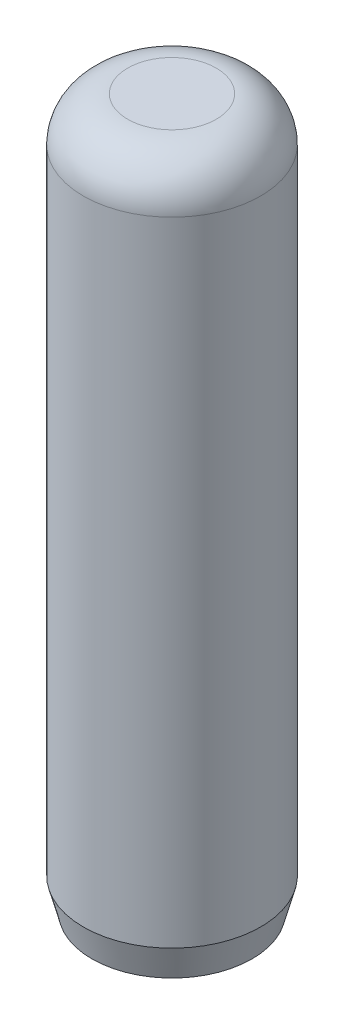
from build123d import *


with BuildPart() as part:
    # Sketch1 → Base-Revolve (revolve)
    with BuildSketch(Plane.XY, mode=Mode.PRIVATE) as base_revolve_sk:
        with BuildLine():
            Line((0.00381, 0), (0.00381, 12.7))
            Line((0.00381, 12.7), (0.79756, 12.7))
            ThreePointArc((0.79756, 12.7), (1.358826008, 12.467516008), (1.59131, 11.90625))
            Line((1.59131, 11.90625), (1.59131, 0.572109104))
            Line((1.59131, 0.572109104), (1.438013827, 0))
            Line((1.438013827, 0), (0.00381, 0))
        make_face()
    revolve(base_revolve_sk.sketch.rotate(Axis((0.00381, 0, 0), (0, 1, 0)), 90), axis=Axis((0.00381, 0, 0), (0, 1, 0)))


solid = part.part
